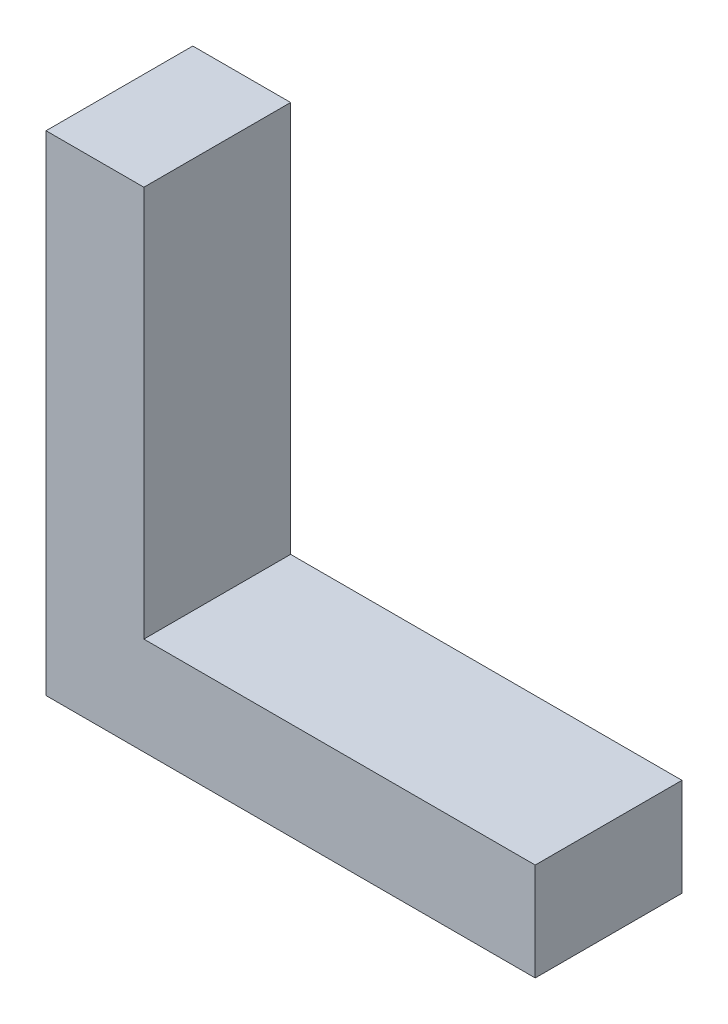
ISO-10303-21;
HEADER;
FILE_DESCRIPTION(('STEP AP214'),'2;1');
FILE_NAME('part.step','',(''),(''),'','','');
FILE_SCHEMA(('AUTOMOTIVE_DESIGN { 1 0 10303 214 1 1 1 1 }'));
ENDSEC;
DATA;
#1=APPLICATION_CONTEXT('core data for automotive mechanical design processes');
#2=APPLICATION_PROTOCOL_DEFINITION('international standard','automotive_design',2000,#1);
#3=PRODUCT_CONTEXT('',#1,'mechanical');
#4=PRODUCT('Part','Part','',(#3));
#5=PRODUCT_RELATED_PRODUCT_CATEGORY('part','',(#4));
#6=PRODUCT_DEFINITION_FORMATION('','',#4);
#7=PRODUCT_DEFINITION_CONTEXT('part definition',#1,'design');
#8=PRODUCT_DEFINITION('design','',#6,#7);
#9=PRODUCT_DEFINITION_SHAPE('','',#8);
#10=(LENGTH_UNIT() NAMED_UNIT(*) SI_UNIT(.MILLI.,.METRE.));
#11=(NAMED_UNIT(*) PLANE_ANGLE_UNIT() SI_UNIT($,.RADIAN.));
#12=(NAMED_UNIT(*) SI_UNIT($,.STERADIAN.) SOLID_ANGLE_UNIT());
#13=UNCERTAINTY_MEASURE_WITH_UNIT(LENGTH_MEASURE(1.E-05),#10,'distance_accuracy_value','');
#14=(GEOMETRIC_REPRESENTATION_CONTEXT(3) GLOBAL_UNCERTAINTY_ASSIGNED_CONTEXT((#13)) GLOBAL_UNIT_ASSIGNED_CONTEXT((#10,
#11,#12)) REPRESENTATION_CONTEXT('',''));
#15=CARTESIAN_POINT('',(0.,0.,0.));
#16=DIRECTION('',(0.,0.,1.));
#17=DIRECTION('',(1.,0.,0.));
#18=AXIS2_PLACEMENT_3D('',#15,#16,#17);
#19=CARTESIAN_POINT('',(0.,0.,30.));
#20=DIRECTION('',(1.,0.,0.));
#21=DIRECTION('',(0.,0.,-1.));
#22=AXIS2_PLACEMENT_3D('',#19,#20,#21);
#23=PLANE('',#22);
#24=DIRECTION('',(0.,-1.,0.));
#25=VECTOR('',#24,1.);
#26=CARTESIAN_POINT('',(0.,0.,0.));
#27=LINE('',#26,#25);
#28=CARTESIAN_POINT('',(0.,100.,0.));
#29=VERTEX_POINT('',#28);
#30=CARTESIAN_POINT('',(0.,0.,0.));
#31=VERTEX_POINT('',#30);
#32=EDGE_CURVE('E84',#29,#31,#27,.T.);
#33=ORIENTED_EDGE('',*,*,#32,.T.);
#34=DIRECTION('',(0.,0.,-1.));
#35=VECTOR('',#34,1.);
#36=CARTESIAN_POINT('',(0.,0.,30.));
#37=LINE('',#36,#35);
#38=CARTESIAN_POINT('',(0.,0.,30.));
#39=VERTEX_POINT('',#38);
#40=EDGE_CURVE('E11',#39,#31,#37,.T.);
#41=ORIENTED_EDGE('',*,*,#40,.F.);
#42=DIRECTION('',(0.,-1.,0.));
#43=VECTOR('',#42,1.);
#44=CARTESIAN_POINT('',(0.,0.,30.));
#45=LINE('',#44,#43);
#46=CARTESIAN_POINT('',(0.,100.,30.));
#47=VERTEX_POINT('',#46);
#48=EDGE_CURVE('E107',#47,#39,#45,.T.);
#49=ORIENTED_EDGE('',*,*,#48,.F.);
#50=DIRECTION('',(0.,0.,-1.));
#51=VECTOR('',#50,1.);
#52=CARTESIAN_POINT('',(0.,100.,30.));
#53=LINE('',#52,#51);
#54=EDGE_CURVE('E97',#47,#29,#53,.T.);
#55=ORIENTED_EDGE('',*,*,#54,.T.);
#56=EDGE_LOOP('',(#33,#41,#49,#55));
#57=FACE_BOUND('',#56,.T.);
#58=ADVANCED_FACE('F28',(#57),#23,.F.);
#59=CARTESIAN_POINT('',(0.,0.,30.));
#60=DIRECTION('',(0.,1.,0.));
#61=DIRECTION('',(0.,0.,1.));
#62=AXIS2_PLACEMENT_3D('',#59,#60,#61);
#63=PLANE('',#62);
#64=DIRECTION('',(1.,0.,0.));
#65=VECTOR('',#64,1.);
#66=CARTESIAN_POINT('',(0.,0.,0.));
#67=LINE('',#66,#65);
#68=CARTESIAN_POINT('',(100.,0.,0.));
#69=VERTEX_POINT('',#68);
#70=EDGE_CURVE('E80',#31,#69,#67,.T.);
#71=ORIENTED_EDGE('',*,*,#70,.T.);
#72=DIRECTION('',(0.,0.,-1.));
#73=VECTOR('',#72,1.);
#74=CARTESIAN_POINT('',(100.,0.,30.));
#75=LINE('',#74,#73);
#76=CARTESIAN_POINT('',(100.,0.,30.));
#77=VERTEX_POINT('',#76);
#78=EDGE_CURVE('E35',#77,#69,#75,.T.);
#79=ORIENTED_EDGE('',*,*,#78,.F.);
#80=DIRECTION('',(1.,0.,0.));
#81=VECTOR('',#80,1.);
#82=CARTESIAN_POINT('',(0.,0.,30.));
#83=LINE('',#82,#81);
#84=EDGE_CURVE('E93',#39,#77,#83,.T.);
#85=ORIENTED_EDGE('',*,*,#84,.F.);
#86=ORIENTED_EDGE('',*,*,#40,.T.);
#87=EDGE_LOOP('',(#71,#79,#85,#86));
#88=FACE_BOUND('',#87,.T.);
#89=ADVANCED_FACE('F92',(#88),#63,.F.);
#90=CARTESIAN_POINT('',(100.,0.,30.));
#91=DIRECTION('',(-1.,0.,0.));
#92=DIRECTION('',(0.,0.,1.));
#93=AXIS2_PLACEMENT_3D('',#90,#91,#92);
#94=PLANE('',#93);
#95=DIRECTION('',(0.,1.,0.));
#96=VECTOR('',#95,1.);
#97=CARTESIAN_POINT('',(100.,0.,0.));
#98=LINE('',#97,#96);
#99=CARTESIAN_POINT('',(100.,20.,0.));
#100=VERTEX_POINT('',#99);
#101=EDGE_CURVE('E86',#69,#100,#98,.T.);
#102=ORIENTED_EDGE('',*,*,#101,.T.);
#103=DIRECTION('',(0.,0.,-1.));
#104=VECTOR('',#103,1.);
#105=CARTESIAN_POINT('',(100.,20.,30.));
#106=LINE('',#105,#104);
#107=CARTESIAN_POINT('',(100.,20.,30.));
#108=VERTEX_POINT('',#107);
#109=EDGE_CURVE('E123',#108,#100,#106,.T.);
#110=ORIENTED_EDGE('',*,*,#109,.F.);
#111=DIRECTION('',(0.,1.,0.));
#112=VECTOR('',#111,1.);
#113=CARTESIAN_POINT('',(100.,0.,30.));
#114=LINE('',#113,#112);
#115=EDGE_CURVE('E110',#77,#108,#114,.T.);
#116=ORIENTED_EDGE('',*,*,#115,.F.);
#117=ORIENTED_EDGE('',*,*,#78,.T.);
#118=EDGE_LOOP('',(#102,#110,#116,#117));
#119=FACE_BOUND('',#118,.T.);
#120=ADVANCED_FACE('F127',(#119),#94,.F.);
#121=CARTESIAN_POINT('',(20.,20.,30.));
#122=DIRECTION('',(0.,-1.,0.));
#123=DIRECTION('',(0.,0.,-1.));
#124=AXIS2_PLACEMENT_3D('',#121,#122,#123);
#125=PLANE('',#124);
#126=DIRECTION('',(-1.,0.,0.));
#127=VECTOR('',#126,1.);
#128=CARTESIAN_POINT('',(20.,20.,0.));
#129=LINE('',#128,#127);
#130=CARTESIAN_POINT('',(20.,20.,0.));
#131=VERTEX_POINT('',#130);
#132=EDGE_CURVE('E101',#100,#131,#129,.T.);
#133=ORIENTED_EDGE('',*,*,#132,.T.);
#134=DIRECTION('',(0.,0.,-1.));
#135=VECTOR('',#134,1.);
#136=CARTESIAN_POINT('',(20.,20.,30.));
#137=LINE('',#136,#135);
#138=CARTESIAN_POINT('',(20.,20.,30.));
#139=VERTEX_POINT('',#138);
#140=EDGE_CURVE('E120',#139,#131,#137,.T.);
#141=ORIENTED_EDGE('',*,*,#140,.F.);
#142=DIRECTION('',(-1.,0.,0.));
#143=VECTOR('',#142,1.);
#144=CARTESIAN_POINT('',(20.,20.,30.));
#145=LINE('',#144,#143);
#146=EDGE_CURVE('E112',#108,#139,#145,.T.);
#147=ORIENTED_EDGE('',*,*,#146,.F.);
#148=ORIENTED_EDGE('',*,*,#109,.T.);
#149=EDGE_LOOP('',(#133,#141,#147,#148));
#150=FACE_BOUND('',#149,.T.);
#151=ADVANCED_FACE('F133',(#150),#125,.F.);
#152=CARTESIAN_POINT('',(20.,100.,30.));
#153=DIRECTION('',(-1.,0.,0.));
#154=DIRECTION('',(0.,0.,1.));
#155=AXIS2_PLACEMENT_3D('',#152,#153,#154);
#156=PLANE('',#155);
#157=DIRECTION('',(0.,1.,0.));
#158=VECTOR('',#157,1.);
#159=CARTESIAN_POINT('',(20.,100.,0.));
#160=LINE('',#159,#158);
#161=CARTESIAN_POINT('',(20.,100.,0.));
#162=VERTEX_POINT('',#161);
#163=EDGE_CURVE('E103',#131,#162,#160,.T.);
#164=ORIENTED_EDGE('',*,*,#163,.T.);
#165=DIRECTION('',(0.,0.,-1.));
#166=VECTOR('',#165,1.);
#167=CARTESIAN_POINT('',(20.,100.,30.));
#168=LINE('',#167,#166);
#169=CARTESIAN_POINT('',(20.,100.,30.));
#170=VERTEX_POINT('',#169);
#171=EDGE_CURVE('E117',#170,#162,#168,.T.);
#172=ORIENTED_EDGE('',*,*,#171,.F.);
#173=DIRECTION('',(0.,1.,0.));
#174=VECTOR('',#173,1.);
#175=CARTESIAN_POINT('',(20.,100.,30.));
#176=LINE('',#175,#174);
#177=EDGE_CURVE('E47',#139,#170,#176,.T.);
#178=ORIENTED_EDGE('',*,*,#177,.F.);
#179=ORIENTED_EDGE('',*,*,#140,.T.);
#180=EDGE_LOOP('',(#164,#172,#178,#179));
#181=FACE_BOUND('',#180,.T.);
#182=ADVANCED_FACE('F136',(#181),#156,.F.);
#183=CARTESIAN_POINT('',(0.,100.,30.));
#184=DIRECTION('',(0.,-1.,0.));
#185=DIRECTION('',(0.,0.,-1.));
#186=AXIS2_PLACEMENT_3D('',#183,#184,#185);
#187=PLANE('',#186);
#188=DIRECTION('',(-1.,0.,0.));
#189=VECTOR('',#188,1.);
#190=CARTESIAN_POINT('',(0.,100.,0.));
#191=LINE('',#190,#189);
#192=EDGE_CURVE('E105',#162,#29,#191,.T.);
#193=ORIENTED_EDGE('',*,*,#192,.T.);
#194=ORIENTED_EDGE('',*,*,#54,.F.);
#195=DIRECTION('',(-1.,0.,0.));
#196=VECTOR('',#195,1.);
#197=CARTESIAN_POINT('',(0.,100.,30.));
#198=LINE('',#197,#196);
#199=EDGE_CURVE('E42',#170,#47,#198,.T.);
#200=ORIENTED_EDGE('',*,*,#199,.F.);
#201=ORIENTED_EDGE('',*,*,#171,.T.);
#202=EDGE_LOOP('',(#193,#194,#200,#201));
#203=FACE_BOUND('',#202,.T.);
#204=ADVANCED_FACE('F138',(#203),#187,.F.);
#205=CARTESIAN_POINT('',(0.,100.,30.));
#206=DIRECTION('',(0.,0.,-1.));
#207=DIRECTION('',(-1.,0.,0.));
#208=AXIS2_PLACEMENT_3D('',#205,#206,#207);
#209=PLANE('',#208);
#210=ORIENTED_EDGE('',*,*,#48,.T.);
#211=ORIENTED_EDGE('',*,*,#84,.T.);
#212=ORIENTED_EDGE('',*,*,#115,.T.);
#213=ORIENTED_EDGE('',*,*,#146,.T.);
#214=ORIENTED_EDGE('',*,*,#177,.T.);
#215=ORIENTED_EDGE('',*,*,#199,.T.);
#216=EDGE_LOOP('',(#210,#211,#212,#213,#214,#215));
#217=FACE_BOUND('',#216,.T.);
#218=ADVANCED_FACE('F130',(#217),#209,.F.);
#219=CARTESIAN_POINT('',(0.,100.,0.));
#220=DIRECTION('',(0.,0.,-1.));
#221=DIRECTION('',(-1.,0.,0.));
#222=AXIS2_PLACEMENT_3D('',#219,#220,#221);
#223=PLANE('',#222);
#224=ORIENTED_EDGE('',*,*,#32,.F.);
#225=ORIENTED_EDGE('',*,*,#192,.F.);
#226=ORIENTED_EDGE('',*,*,#163,.F.);
#227=ORIENTED_EDGE('',*,*,#132,.F.);
#228=ORIENTED_EDGE('',*,*,#101,.F.);
#229=ORIENTED_EDGE('',*,*,#70,.F.);
#230=EDGE_LOOP('',(#224,#225,#226,#227,#228,#229));
#231=FACE_BOUND('',#230,.T.);
#232=ADVANCED_FACE('F81',(#231),#223,.T.);
#233=CLOSED_SHELL('',(#58,#89,#120,#151,#182,#204,#218,#232));
#234=MANIFOLD_SOLID_BREP('B2',#233);
#235=ADVANCED_BREP_SHAPE_REPRESENTATION('',(#18,#234),#14);
#236=SHAPE_DEFINITION_REPRESENTATION(#9,#235);
ENDSEC;
END-ISO-10303-21;
